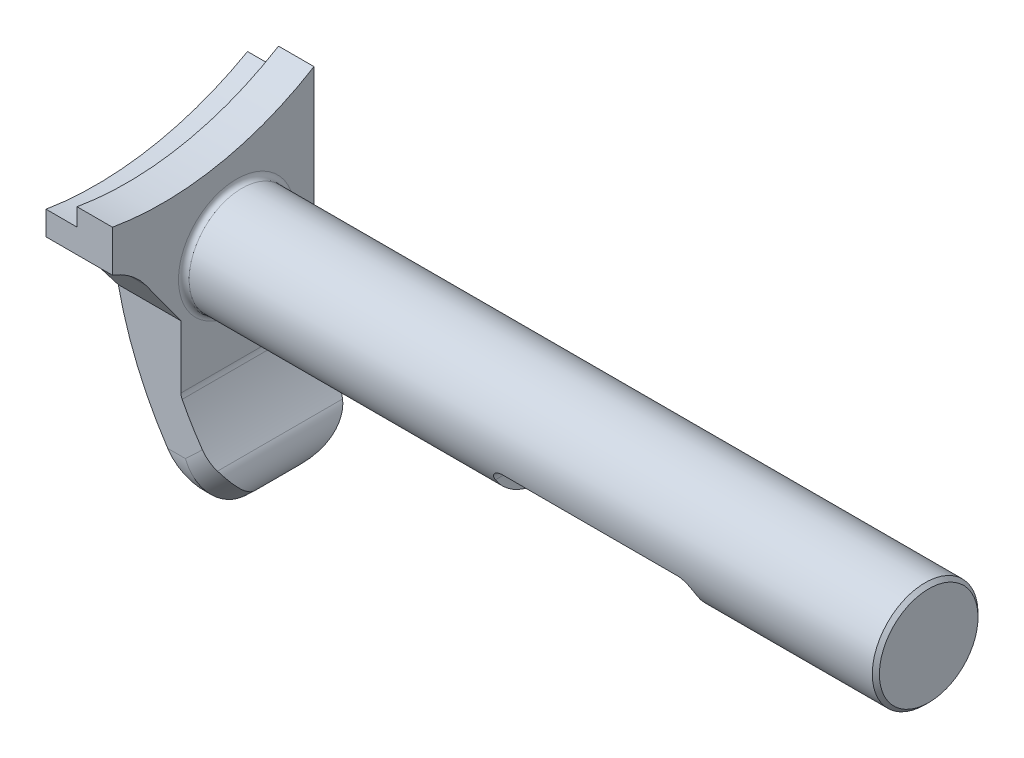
ISO-10303-21;
HEADER;
FILE_DESCRIPTION(('STEP AP214'),'2;1');
FILE_NAME('part.step','',(''),(''),'','','');
FILE_SCHEMA(('AUTOMOTIVE_DESIGN { 1 0 10303 214 1 1 1 1 }'));
ENDSEC;
DATA;
#1=APPLICATION_CONTEXT('core data for automotive mechanical design processes');
#2=APPLICATION_PROTOCOL_DEFINITION('international standard','automotive_design',2000,#1);
#3=PRODUCT_CONTEXT('',#1,'mechanical');
#4=PRODUCT('Part','Part','',(#3));
#5=PRODUCT_RELATED_PRODUCT_CATEGORY('part','',(#4));
#6=PRODUCT_DEFINITION_FORMATION('','',#4);
#7=PRODUCT_DEFINITION_CONTEXT('part definition',#1,'design');
#8=PRODUCT_DEFINITION('design','',#6,#7);
#9=PRODUCT_DEFINITION_SHAPE('','',#8);
#10=(LENGTH_UNIT() NAMED_UNIT(*) SI_UNIT(.MILLI.,.METRE.));
#11=(NAMED_UNIT(*) PLANE_ANGLE_UNIT() SI_UNIT($,.RADIAN.));
#12=(NAMED_UNIT(*) SI_UNIT($,.STERADIAN.) SOLID_ANGLE_UNIT());
#13=UNCERTAINTY_MEASURE_WITH_UNIT(LENGTH_MEASURE(1.E-05),#10,'distance_accuracy_value','');
#14=(GEOMETRIC_REPRESENTATION_CONTEXT(3) GLOBAL_UNCERTAINTY_ASSIGNED_CONTEXT((#13)) GLOBAL_UNIT_ASSIGNED_CONTEXT((#10,
#11,#12)) REPRESENTATION_CONTEXT('',''));
#15=CARTESIAN_POINT('',(0.,0.,0.));
#16=DIRECTION('',(0.,0.,1.));
#17=DIRECTION('',(1.,0.,0.));
#18=AXIS2_PLACEMENT_3D('',#15,#16,#17);
#19=CARTESIAN_POINT('',(15.9689446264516,-0.720330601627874,0.812800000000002));
#20=DIRECTION('',(-0.726548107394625,-0.687115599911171,0.));
#21=DIRECTION('',(0.687115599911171,-0.726548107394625,0.));
#22=AXIS2_PLACEMENT_3D('',#19,#20,#21);
#23=CYLINDRICAL_SURFACE('',#22,3.175);
#24=CARTESIAN_POINT('',(5.08083712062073,-11.0174994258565,0.812800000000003));
#25=DIRECTION('',(-0.929125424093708,-0.369764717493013,0.));
#26=DIRECTION('',(-0.369764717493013,0.929125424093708,0.));
#27=AXIS2_PLACEMENT_3D('',#24,#25,#26);
#28=ELLIPSE('',#27,3.41719203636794,3.175);
#29=CARTESIAN_POINT('',(6.34439416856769,-14.1924994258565,0.812800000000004));
#30=VERTEX_POINT('',#29);
#31=CARTESIAN_POINT('',(5.08083712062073,-11.0174994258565,3.9878));
#32=VERTEX_POINT('',#31);
#33=EDGE_CURVE('E454',#30,#32,#28,.T.);
#34=ORIENTED_EDGE('',*,*,#33,.F.);
#35=DIRECTION('',(0.726548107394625,0.687115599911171,0.));
#36=VECTOR('',#35,1.);
#37=CARTESIAN_POINT('',(18.1505366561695,-3.02712084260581,0.812800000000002));
#38=LINE('',#37,#36);
#39=CARTESIAN_POINT('',(6.89408845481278,-13.6726391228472,0.812800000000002));
#40=VERTEX_POINT('',#39);
#41=EDGE_CURVE('E12',#40,#30,#38,.F.);
#42=ORIENTED_EDGE('',*,*,#41,.F.);
#43=CARTESIAN_POINT('',(7.08959376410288,-10.9331868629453,3.7008595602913));
#44=CARTESIAN_POINT('',(7.12742421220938,-10.9808520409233,3.67318629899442));
#45=CARTESIAN_POINT('',(7.16255801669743,-11.0295296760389,3.64368845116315));
#46=CARTESIAN_POINT('',(7.22751612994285,-11.1282000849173,3.58146991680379));
#47=CARTESIAN_POINT('',(7.25734958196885,-11.1781904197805,3.54875493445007));
#48=CARTESIAN_POINT('',(7.3116393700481,-11.2784257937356,3.48078280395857));
#49=CARTESIAN_POINT('',(7.33614813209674,-11.3286628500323,3.44555545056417));
#50=CARTESIAN_POINT('',(7.38041727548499,-11.4294369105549,3.37260769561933));
#51=CARTESIAN_POINT('',(7.40017501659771,-11.479974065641,3.33488592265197));
#52=CARTESIAN_POINT('',(7.46243896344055,-11.6595013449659,3.19687695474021));
#53=CARTESIAN_POINT('',(7.49253782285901,-11.7882725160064,3.09052191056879));
#54=CARTESIAN_POINT('',(7.52798101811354,-12.0410690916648,2.86773133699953));
#55=CARTESIAN_POINT('',(7.53319262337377,-12.1650655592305,2.75124512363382));
#56=CARTESIAN_POINT('',(7.52425621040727,-12.3688188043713,2.54818478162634));
#57=CARTESIAN_POINT('',(7.51551447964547,-12.4505601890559,2.46328913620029));
#58=CARTESIAN_POINT('',(7.48896980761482,-12.6099023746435,2.2910439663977));
#59=CARTESIAN_POINT('',(7.47116308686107,-12.6875014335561,2.20369343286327));
#60=CARTESIAN_POINT('',(7.40558444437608,-12.9133961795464,1.93904298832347));
#61=CARTESIAN_POINT('',(7.3456383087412,-13.0550263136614,1.75890672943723));
#62=CARTESIAN_POINT('',(7.22192544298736,-13.2767310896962,1.45218872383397));
#63=CARTESIAN_POINT('',(7.16521864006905,-13.3622029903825,1.32647961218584));
#64=CARTESIAN_POINT('',(7.04043989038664,-13.5228751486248,1.07435329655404));
#65=CARTESIAN_POINT('',(6.97238658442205,-13.5980918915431,0.947937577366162));
#66=CARTESIAN_POINT('',(6.89749554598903,-13.6694113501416,0.818666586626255));
#67=CARTESIAN_POINT('',(6.89579338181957,-13.6710267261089,0.815733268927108));
#68=CARTESIAN_POINT('',(6.89408845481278,-13.6726391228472,0.812800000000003));
#69=B_SPLINE_CURVE_WITH_KNOTS('',3,(#43,#44,#45,#46,#47,#48,#49,#50,#51,#52,#53,#54,#55,#56,#57,
#58,#59,#60,#61,#62,#63,#64,#65,#66,#67,#68),.UNSPECIFIED.,.F.,.F.,(4,2,2,2,2,2,2,2,2,2,2,2,4),
(0.,0.200392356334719,0.400435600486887,0.598409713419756,0.796493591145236,1.30263115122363,
1.81146509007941,2.16553187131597,2.5197463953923,3.2271799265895,3.7133370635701,
4.19870323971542,4.20997267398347),.UNSPECIFIED.);
#70=CARTESIAN_POINT('',(7.08959376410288,-10.9331868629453,3.7008595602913));
#71=VERTEX_POINT('',#70);
#72=EDGE_CURVE('E47',#71,#40,#69,.T.);
#73=ORIENTED_EDGE('',*,*,#72,.F.);
#74=CARTESIAN_POINT('',(6.29662382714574,-9.867698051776,3.9878));
#75=CARTESIAN_POINT('',(6.34833857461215,-9.94188949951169,3.98781058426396));
#76=CARTESIAN_POINT('',(6.40053418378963,-10.0157495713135,3.98402127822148));
#77=CARTESIAN_POINT('',(6.50547693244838,-10.1622916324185,3.96887352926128));
#78=CARTESIAN_POINT('',(6.55822407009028,-10.2349736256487,3.95751511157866));
#79=CARTESIAN_POINT('',(6.66239395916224,-10.3766507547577,3.92767968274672));
#80=CARTESIAN_POINT('',(6.71381283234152,-10.4456922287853,3.90940901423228));
#81=CARTESIAN_POINT('',(6.81637954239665,-10.5817252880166,3.86583957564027));
#82=CARTESIAN_POINT('',(6.86752738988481,-10.6487169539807,3.8405410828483));
#83=CARTESIAN_POINT('',(6.96915382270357,-10.7802494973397,3.78305274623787));
#84=CARTESIAN_POINT('',(7.01963215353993,-10.8447894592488,3.75086035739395));
#85=CARTESIAN_POINT('',(7.11947266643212,-10.970995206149,3.67979311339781));
#86=CARTESIAN_POINT('',(7.16883479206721,-11.0326608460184,3.64091792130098));
#87=CARTESIAN_POINT('',(7.26739392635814,-11.1544568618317,3.5555373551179));
#88=CARTESIAN_POINT('',(7.31654603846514,-11.214493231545,3.50884592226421));
#89=CARTESIAN_POINT('',(7.41274498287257,-11.3307730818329,3.40900434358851));
#90=CARTESIAN_POINT('',(7.45979164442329,-11.3870162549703,3.3558536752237));
#91=CARTESIAN_POINT('',(7.50554950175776,-11.441179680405,3.29964854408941));
#92=B_SPLINE_CURVE_WITH_KNOTS('',3,(#74,#75,#76,#77,#78,#79,#80,#81,#82,#83,#84,#85,#86,#87,#88,
#89,#90,#91),.UNSPECIFIED.,.F.,.F.,(4,2,2,2,2,2,2,2,4),(0.,0.271233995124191,0.542467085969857,
0.806171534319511,1.06986557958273,1.33365714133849,1.59746200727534,1.86879383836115,
2.14014763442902),.UNSPECIFIED.);
#93=CARTESIAN_POINT('',(6.29662382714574,-9.867698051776,3.9878));
#94=VERTEX_POINT('',#93);
#95=EDGE_CURVE('E305',#94,#71,#92,.T.);
#96=ORIENTED_EDGE('',*,*,#95,.F.);
#97=DIRECTION('',(0.726548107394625,0.687115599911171,0.));
#98=VECTOR('',#97,1.);
#99=CARTESIAN_POINT('',(15.9689446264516,-0.720330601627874,3.9878));
#100=LINE('',#99,#98);
#101=EDGE_CURVE('E312',#32,#94,#100,.T.);
#102=ORIENTED_EDGE('',*,*,#101,.F.);
#103=EDGE_LOOP('',(#34,#42,#73,#96,#102));
#104=FACE_BOUND('',#103,.T.);
#105=ADVANCED_FACE('F39',(#104),#23,.T.);
#106=CARTESIAN_POINT('',(21.4600745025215,4.47277493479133,-2.3622));
#107=DIRECTION('',(0.726548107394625,0.687115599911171,0.));
#108=DIRECTION('',(-0.687115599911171,0.726548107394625,0.));
#109=AXIS2_PLACEMENT_3D('',#106,#107,#108);
#110=CYLINDRICAL_SURFACE('',#109,3.175);
#111=DIRECTION('',(-0.726548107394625,-0.687115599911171,0.));
#112=VECTOR('',#111,1.);
#113=CARTESIAN_POINT('',(21.4600745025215,4.47277493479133,-5.5372));
#114=LINE('',#113,#112);
#115=CARTESIAN_POINT('',(6.29662382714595,-9.86769805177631,-5.5372));
#116=VERTEX_POINT('',#115);
#117=CARTESIAN_POINT('',(5.08083712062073,-11.0174994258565,-5.5372));
#118=VERTEX_POINT('',#117);
#119=EDGE_CURVE('E417',#116,#118,#114,.T.);
#120=ORIENTED_EDGE('',*,*,#119,.F.);
#121=CARTESIAN_POINT('',(7.08959376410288,-10.9331868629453,-5.2502595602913));
#122=CARTESIAN_POINT('',(7.03824775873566,-10.8684904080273,-5.28785242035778));
#123=CARTESIAN_POINT('',(6.98627826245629,-10.8022243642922,-5.32188655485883));
#124=CARTESIAN_POINT('',(6.88156512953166,-10.6670249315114,-5.38265091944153));
#125=CARTESIAN_POINT('',(6.82882159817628,-10.5980919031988,-5.40938213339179));
#126=CARTESIAN_POINT('',(6.72446781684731,-10.4599306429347,-5.45473483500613));
#127=CARTESIAN_POINT('',(6.67286608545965,-10.3907621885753,-5.47355835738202));
#128=CARTESIAN_POINT('',(6.56977247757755,-10.2507874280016,-5.50403470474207));
#129=CARTESIAN_POINT('',(6.51828059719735,-10.1799811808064,-5.51568778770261));
#130=CARTESIAN_POINT('',(6.41582470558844,-10.0372456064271,-5.53177435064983));
#131=CARTESIAN_POINT('',(6.36486038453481,-9.96531700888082,-5.53621233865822));
#132=CARTESIAN_POINT('',(6.26378480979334,-9.82077642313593,-5.53789315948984));
#133=CARTESIAN_POINT('',(6.21367359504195,-9.74816440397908,-5.53513566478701));
#134=CARTESIAN_POINT('',(6.11324265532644,-9.60070313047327,-5.52230196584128));
#135=CARTESIAN_POINT('',(6.06295687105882,-9.5258485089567,-5.51202164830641));
#136=CARTESIAN_POINT('',(5.96396208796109,-9.37648878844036,-5.48403581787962));
#137=CARTESIAN_POINT('',(5.91525303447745,-9.30198367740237,-5.46633056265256));
#138=CARTESIAN_POINT('',(5.86749137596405,-9.22792470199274,-5.44497416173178));
#139=B_SPLINE_CURVE_WITH_KNOTS('',3,(#121,#122,#123,#124,#125,#126,#127,#128,#129,#130,#131,
#132,#133,#134,#135,#136,#137,#138),.UNSPECIFIED.,.F.,.F.,(4,2,2,2,2,2,2,2,4),(0.,
0.272157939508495,0.544279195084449,0.808948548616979,1.07360837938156,1.33810278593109,
1.60260923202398,1.87457175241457,2.1465248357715),.UNSPECIFIED.);
#140=CARTESIAN_POINT('',(7.08959376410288,-10.9331868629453,-5.2502595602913));
#141=VERTEX_POINT('',#140);
#142=EDGE_CURVE('E297',#141,#116,#139,.T.);
#143=ORIENTED_EDGE('',*,*,#142,.F.);
#144=CARTESIAN_POINT('',(6.89408845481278,-13.6726391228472,-2.3622));
#145=CARTESIAN_POINT('',(6.89579334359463,-13.6710267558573,-2.36513321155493));
#146=CARTESIAN_POINT('',(6.89749550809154,-13.6694113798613,-2.36806652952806));
#147=CARTESIAN_POINT('',(7.02872234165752,-13.5444432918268,-2.59457927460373));
#148=CARTESIAN_POINT('',(7.14237622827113,-13.4036477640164,-2.81873325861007));
#149=CARTESIAN_POINT('',(7.28375568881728,-13.1699280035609,-3.15120800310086));
#150=CARTESIAN_POINT('',(7.32607678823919,-13.0881160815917,-3.26158265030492));
#151=CARTESIAN_POINT('',(7.39989761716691,-12.917368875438,-3.48040227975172));
#152=CARTESIAN_POINT('',(7.4314040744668,-12.8284380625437,-3.58884842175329));
#153=CARTESIAN_POINT('',(7.49106360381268,-12.612007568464,-3.84001883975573));
#154=CARTESIAN_POINT('',(7.51429347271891,-12.4818013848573,-3.98163501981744));
#155=CARTESIAN_POINT('',(7.53432625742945,-12.2112097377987,-4.25677066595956));
#156=CARTESIAN_POINT('',(7.5311738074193,-12.070841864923,-4.39030342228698));
#157=CARTESIAN_POINT('',(7.49771181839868,-11.8205113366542,-4.61190213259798));
#158=CARTESIAN_POINT('',(7.47464636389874,-11.7120881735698,-4.70278735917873));
#159=CARTESIAN_POINT('',(7.40807651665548,-11.494137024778,-4.87492440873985));
#160=CARTESIAN_POINT('',(7.36464948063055,-11.3846147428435,-4.95621124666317));
#161=CARTESIAN_POINT('',(7.28817739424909,-11.2339458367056,-5.06062295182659));
#162=CARTESIAN_POINT('',(7.26475828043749,-11.1915375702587,-5.08917168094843));
#163=CARTESIAN_POINT('',(7.21424780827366,-11.1075002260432,-5.14407294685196));
#164=CARTESIAN_POINT('',(7.18715792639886,-11.0658708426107,-5.17042635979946));
#165=CARTESIAN_POINT('',(7.12899182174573,-10.9834341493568,-5.22091996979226));
#166=CARTESIAN_POINT('',(7.09788496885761,-10.9426362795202,-5.24504042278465));
#167=CARTESIAN_POINT('',(7.03182955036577,-10.8626170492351,-5.29064550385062));
#168=CARTESIAN_POINT('',(6.99687635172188,-10.8233976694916,-5.31212688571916));
#169=CARTESIAN_POINT('',(6.96002303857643,-10.7852188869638,-5.3321696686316));
#170=B_SPLINE_CURVE_WITH_KNOTS('',3,(#144,#145,#146,#147,#148,#149,#150,#151,#152,#153,#154,
#155,#156,#157,#158,#159,#160,#161,#162,#163,#164,#165,#166,#167,#168,#169),.UNSPECIFIED.,.F.,
.F.,(4,2,2,2,2,2,2,2,2,2,2,2,4),(0.,0.0112694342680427,0.870203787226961,1.30106945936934,
1.73166660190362,2.31109802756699,2.8895493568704,3.31820331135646,3.74524177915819,
3.91380394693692,4.08229851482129,4.2521635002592,4.42223538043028),.UNSPECIFIED.);
#171=CARTESIAN_POINT('',(6.89408845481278,-13.6726391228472,-2.3622));
#172=VERTEX_POINT('',#171);
#173=EDGE_CURVE('E423',#172,#141,#170,.T.);
#174=ORIENTED_EDGE('',*,*,#173,.F.);
#175=DIRECTION('',(-0.726548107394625,-0.687115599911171,0.));
#176=VECTOR('',#175,1.);
#177=CARTESIAN_POINT('',(23.6416665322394,2.1659846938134,-2.3622));
#178=LINE('',#177,#176);
#179=CARTESIAN_POINT('',(6.34439416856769,-14.1924994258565,-2.36219999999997));
#180=VERTEX_POINT('',#179);
#181=EDGE_CURVE('E328',#180,#172,#178,.F.);
#182=ORIENTED_EDGE('',*,*,#181,.F.);
#183=CARTESIAN_POINT('',(5.08083712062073,-11.0174994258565,-2.3622));
#184=DIRECTION('',(-0.929125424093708,-0.369764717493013,0.));
#185=DIRECTION('',(-0.369764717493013,0.929125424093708,0.));
#186=AXIS2_PLACEMENT_3D('',#183,#184,#185);
#187=ELLIPSE('',#186,3.41719203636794,3.175);
#188=EDGE_CURVE('E420',#118,#180,#187,.T.);
#189=ORIENTED_EDGE('',*,*,#188,.F.);
#190=EDGE_LOOP('',(#120,#143,#174,#182,#189));
#191=FACE_BOUND('',#190,.T.);
#192=ADVANCED_FACE('F428',(#191),#110,.T.);
#193=CARTESIAN_POINT('',(0.,0.,8.89));
#194=DIRECTION('',(1.,0.,0.));
#195=DIRECTION('',(0.,0.,-1.));
#196=AXIS2_PLACEMENT_3D('',#193,#194,#195);
#197=PLANE('',#196);
#198=DIRECTION('',(0.,-1.,0.));
#199=VECTOR('',#198,1.);
#200=CARTESIAN_POINT('',(0.,0.,8.89));
#201=LINE('',#200,#199);
#202=CARTESIAN_POINT('',(0.,4.35717258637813,8.89));
#203=VERTEX_POINT('',#202);
#204=CARTESIAN_POINT('',(0.,2.64161071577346,8.89));
#205=VERTEX_POINT('',#204);
#206=EDGE_CURVE('E463',#203,#205,#201,.T.);
#207=ORIENTED_EDGE('',*,*,#206,.F.);
#208=CARTESIAN_POINT('',(0.,26.0858,5.3086));
#209=DIRECTION('',(-1.,0.,0.));
#210=DIRECTION('',(0.,0.,1.));
#211=AXIS2_PLACEMENT_3D('',#208,#209,#210);
#212=CIRCLE('',#211,22.0218);
#213=CARTESIAN_POINT('',(0.,6.91998935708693,-5.5372));
#214=VERTEX_POINT('',#213);
#215=EDGE_CURVE('E189',#214,#203,#212,.T.);
#216=ORIENTED_EDGE('',*,*,#215,.F.);
#217=DIRECTION('',(0.,-1.,0.));
#218=VECTOR('',#217,1.);
#219=CARTESIAN_POINT('',(0.,8.36404325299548,-5.5372));
#220=LINE('',#219,#218);
#221=CARTESIAN_POINT('',(0.,-1.10432267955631,-5.5372));
#222=VERTEX_POINT('',#221);
#223=EDGE_CURVE('E194',#214,#222,#220,.T.);
#224=ORIENTED_EDGE('',*,*,#223,.T.);
#225=DIRECTION('',(0.,0.,-1.));
#226=VECTOR('',#225,1.);
#227=CARTESIAN_POINT('',(0.,-1.10432267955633,8.89));
#228=LINE('',#227,#226);
#229=CARTESIAN_POINT('',(0.,-1.10432267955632,5.10013441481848));
#230=VERTEX_POINT('',#229);
#231=EDGE_CURVE('E331',#230,#222,#228,.T.);
#232=ORIENTED_EDGE('',*,*,#231,.F.);
#233=DIRECTION('',(0.,0.809016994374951,0.587785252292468));
#234=VECTOR('',#233,1.);
#235=CARTESIAN_POINT('',(0.,-2.63531965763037,3.9878));
#236=LINE('',#235,#234);
#237=CARTESIAN_POINT('',(0.,0.825397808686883,6.50215841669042));
#238=VERTEX_POINT('',#237);
#239=EDGE_CURVE('E199',#230,#238,#236,.T.);
#240=ORIENTED_EDGE('',*,*,#239,.T.);
#241=CARTESIAN_POINT('',(0.,-2.2352,10.7147099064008));
#242=DIRECTION('',(1.,0.,0.));
#243=DIRECTION('',(0.,0.,-1.));
#244=AXIS2_PLACEMENT_3D('',#241,#242,#243);
#245=CIRCLE('',#244,5.207);
#246=EDGE_CURVE('E202',#238,#205,#245,.T.);
#247=ORIENTED_EDGE('',*,*,#246,.T.);
#248=EDGE_LOOP('',(#207,#216,#224,#232,#240,#247));
#249=FACE_BOUND('',#248,.T.);
#250=ADVANCED_FACE('F432',(#249),#197,.F.);
#251=CARTESIAN_POINT('',(23.876,2.3876,8.89));
#252=DIRECTION('',(0.,0.,-1.));
#253=DIRECTION('',(-1.,0.,0.));
#254=AXIS2_PLACEMENT_3D('',#251,#252,#253);
#255=CYLINDRICAL_SURFACE('',#254,24.13);
#256=CARTESIAN_POINT('',(23.876,2.3876,7.63716474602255));
#257=DIRECTION('',(0.,-0.587785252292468,0.809016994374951));
#258=DIRECTION('',(0.,-0.809016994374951,-0.587785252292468));
#259=AXIS2_PLACEMENT_3D('',#256,#257,#258);
#260=ELLIPSE('',#259,29.8263202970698,24.13);
#261=CARTESIAN_POINT('',(0.274576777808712,-2.63531965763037,3.9878));
#262=VERTEX_POINT('',#261);
#263=EDGE_CURVE('E238',#230,#262,#260,.T.);
#264=ORIENTED_EDGE('',*,*,#263,.F.);
#265=ORIENTED_EDGE('',*,*,#231,.T.);
#266=CARTESIAN_POINT('',(23.876,2.3876,-5.5372));
#267=DIRECTION('',(0.,0.,-1.));
#268=DIRECTION('',(0.,1.,0.));
#269=AXIS2_PLACEMENT_3D('',#266,#267,#268);
#270=CIRCLE('',#269,24.13);
#271=CARTESIAN_POINT('',(3.8120968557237,-11.0174994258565,-5.5372));
#272=VERTEX_POINT('',#271);
#273=EDGE_CURVE('E227',#272,#222,#270,.T.);
#274=ORIENTED_EDGE('',*,*,#273,.F.);
#275=CARTESIAN_POINT('',(6.3443941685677,-14.1924994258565,-2.36219999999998));
#276=CARTESIAN_POINT('',(6.34441563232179,-14.1925176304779,-2.4355954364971));
#277=CARTESIAN_POINT('',(6.34198801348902,-14.1899550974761,-2.50897534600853));
#278=CARTESIAN_POINT('',(6.33239943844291,-14.1798097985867,-2.65501448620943));
#279=CARTESIAN_POINT('',(6.32524255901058,-14.1722313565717,-2.72767428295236));
#280=CARTESIAN_POINT('',(6.30644297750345,-14.1522833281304,-2.87107740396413));
#281=CARTESIAN_POINT('',(6.29484036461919,-14.1399565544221,-2.94183197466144));
#282=CARTESIAN_POINT('',(6.26743762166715,-14.110758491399,-3.08155693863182));
#283=CARTESIAN_POINT('',(6.25163680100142,-14.0938864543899,-3.15052703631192));
#284=CARTESIAN_POINT('',(6.19855082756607,-14.0369967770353,-3.35363141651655));
#285=CARTESIAN_POINT('',(6.15549958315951,-13.9906190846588,-3.48455685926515));
#286=CARTESIAN_POINT('',(6.05700529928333,-13.8834058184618,-3.7354944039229));
#287=CARTESIAN_POINT('',(6.00153204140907,-13.8225349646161,-3.85547887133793));
#288=CARTESIAN_POINT('',(5.85636867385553,-13.6612566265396,-4.13022300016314));
#289=CARTESIAN_POINT('',(5.76198512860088,-13.5548811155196,-4.27901246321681));
#290=CARTESIAN_POINT('',(5.5610065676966,-13.3235909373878,-4.55187846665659));
#291=CARTESIAN_POINT('',(5.45438845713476,-13.198641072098,-4.67590701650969));
#292=CARTESIAN_POINT('',(5.20630364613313,-12.9011368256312,-4.92721473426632));
#293=CARTESIAN_POINT('',(5.06277367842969,-12.724478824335,-5.04760186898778));
#294=CARTESIAN_POINT('',(4.7711228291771,-12.3540483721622,-5.24989737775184));
#295=CARTESIAN_POINT('',(4.62300258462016,-12.1602782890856,-5.3318110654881));
#296=CARTESIAN_POINT('',(4.36298904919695,-11.8086997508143,-5.44112725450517));
#297=CARTESIAN_POINT('',(4.25100296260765,-11.6535359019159,-5.47692410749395));
#298=CARTESIAN_POINT('',(4.08476909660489,-11.4172307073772,-5.51294179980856));
#299=CARTESIAN_POINT('',(4.02970120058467,-11.3379476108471,-5.52200118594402));
#300=CARTESIAN_POINT('',(3.92029614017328,-11.1783929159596,-5.53412924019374));
#301=CARTESIAN_POINT('',(3.86595918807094,-11.0981210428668,-5.5371962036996));
#302=CARTESIAN_POINT('',(3.8120968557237,-11.0174994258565,-5.5372));
#303=B_SPLINE_CURVE_WITH_KNOTS('',3,(#275,#276,#277,#278,#279,#280,#281,#282,#283,#284,#285,
#286,#287,#288,#289,#290,#291,#292,#293,#294,#295,#296,#297,#298,#299,#300,#301,#302),
.UNSPECIFIED.,.F.,.F.,(4,2,2,2,2,2,2,2,2,2,2,2,2,4),(0.,0.220076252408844,0.439963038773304,
0.657911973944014,0.875896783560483,1.31006387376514,1.74529884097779,2.35938065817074,
2.97464134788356,3.74322326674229,4.51169900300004,5.09421199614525,5.38490570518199,
5.67568209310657),.UNSPECIFIED.);
#304=EDGE_CURVE('E240',#180,#272,#303,.T.);
#305=ORIENTED_EDGE('',*,*,#304,.F.);
#306=DIRECTION('',(0.,0.,-1.));
#307=VECTOR('',#306,1.);
#308=CARTESIAN_POINT('',(6.34439416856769,-14.1924994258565,8.89));
#309=LINE('',#308,#307);
#310=EDGE_CURVE('E329',#30,#180,#309,.T.);
#311=ORIENTED_EDGE('',*,*,#310,.F.);
#312=CARTESIAN_POINT('',(3.8120968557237,-11.0174994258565,3.9878));
#313=CARTESIAN_POINT('',(3.88689999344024,-11.1294796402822,3.98779026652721));
#314=CARTESIAN_POINT('',(3.96264056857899,-11.2407948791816,3.98187630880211));
#315=CARTESIAN_POINT('',(4.11537987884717,-11.4613220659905,3.95858342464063));
#316=CARTESIAN_POINT('',(4.19237841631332,-11.5705343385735,3.94120628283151));
#317=CARTESIAN_POINT('',(4.34744935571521,-11.7866873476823,3.89520904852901));
#318=CARTESIAN_POINT('',(4.42552528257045,-11.8936130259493,3.8665300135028));
#319=CARTESIAN_POINT('',(4.5816637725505,-12.1038688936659,3.79820570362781));
#320=CARTESIAN_POINT('',(4.65972633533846,-12.2071990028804,3.75856018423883));
#321=CARTESIAN_POINT('',(4.88921816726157,-12.5060504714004,3.62556663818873));
#322=CARTESIAN_POINT('',(5.03977768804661,-12.6957360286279,3.51701500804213));
#323=CARTESIAN_POINT('',(5.33153939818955,-13.0530241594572,3.25935940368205));
#324=CARTESIAN_POINT('',(5.47276325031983,-13.2206788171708,3.11035372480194));
#325=CARTESIAN_POINT('',(5.69473346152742,-13.4780103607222,2.8254410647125));
#326=CARTESIAN_POINT('',(5.78042650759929,-13.575526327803,2.70044797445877));
#327=CARTESIAN_POINT('',(5.93905174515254,-13.7535565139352,2.43159964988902));
#328=CARTESIAN_POINT('',(6.01200208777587,-13.8340949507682,2.28777176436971));
#329=CARTESIAN_POINT('',(6.12762015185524,-13.9604219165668,2.01205436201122));
#330=CARTESIAN_POINT('',(6.17341329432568,-14.0099141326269,1.8831824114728));
#331=CARTESIAN_POINT('',(6.25012228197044,-14.092343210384,1.61615044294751));
#332=CARTESIAN_POINT('',(6.2810708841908,-14.1253165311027,1.47801164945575));
#333=CARTESIAN_POINT('',(6.31681080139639,-14.163296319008,1.25118147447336));
#334=CARTESIAN_POINT('',(6.32709865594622,-14.1741973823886,1.1642898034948));
#335=CARTESIAN_POINT('',(6.34091347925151,-14.1888191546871,0.989223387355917));
#336=CARTESIAN_POINT('',(6.34442859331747,-14.1925272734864,0.901046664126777));
#337=CARTESIAN_POINT('',(6.3443941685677,-14.1924994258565,0.812800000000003));
#338=B_SPLINE_CURVE_WITH_KNOTS('',3,(#312,#313,#314,#315,#316,#317,#318,#319,#320,#321,#322,
#323,#324,#325,#326,#327,#328,#329,#330,#331,#332,#333,#334,#335,#336,#337),.UNSPECIFIED.,.F.,
.F.,(4,2,2,2,2,2,2,2,2,2,2,2,4),(0.,0.40381738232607,0.807571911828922,1.21346060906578,
1.61935835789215,2.41148969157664,3.20171326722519,3.74053714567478,4.27858713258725,
4.71323635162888,5.14692197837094,5.410926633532,5.67539297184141),.UNSPECIFIED.);
#339=CARTESIAN_POINT('',(3.8120968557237,-11.0174994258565,3.9878));
#340=VERTEX_POINT('',#339);
#341=EDGE_CURVE('E249',#340,#30,#338,.T.);
#342=ORIENTED_EDGE('',*,*,#341,.F.);
#343=CARTESIAN_POINT('',(23.876,2.3876,3.9878));
#344=DIRECTION('',(0.,0.,1.));
#345=DIRECTION('',(0.,-1.,0.));
#346=AXIS2_PLACEMENT_3D('',#343,#344,#345);
#347=CIRCLE('',#346,24.13);
#348=EDGE_CURVE('E235',#262,#340,#347,.T.);
#349=ORIENTED_EDGE('',*,*,#348,.F.);
#350=EDGE_LOOP('',(#264,#265,#274,#305,#311,#342,#349));
#351=FACE_BOUND('',#350,.T.);
#352=ADVANCED_FACE('F256',(#351),#255,.T.);
#353=CARTESIAN_POINT('',(10.0805807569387,-10.6590897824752,8.89));
#354=DIRECTION('',(-0.687115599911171,0.726548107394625,0.));
#355=DIRECTION('',(-0.726548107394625,-0.687115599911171,0.));
#356=AXIS2_PLACEMENT_3D('',#353,#354,#355);
#357=PLANE('',#356);
#358=DIRECTION('',(0.,0.,-1.));
#359=VECTOR('',#358,1.);
#360=CARTESIAN_POINT('',(6.89408845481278,-13.6726391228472,8.89));
#361=LINE('',#360,#359);
#362=EDGE_CURVE('E321',#40,#172,#361,.T.);
#363=ORIENTED_EDGE('',*,*,#362,.F.);
#364=ORIENTED_EDGE('',*,*,#41,.T.);
#365=ORIENTED_EDGE('',*,*,#310,.T.);
#366=ORIENTED_EDGE('',*,*,#181,.T.);
#367=EDGE_LOOP('',(#363,#364,#365,#366));
#368=FACE_BOUND('',#367,.T.);
#369=ADVANCED_FACE('F326',(#368),#357,.F.);
#370=CARTESIAN_POINT('',(5.49786955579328,-12.1962933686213,8.89));
#371=DIRECTION('',(0.,0.,-1.));
#372=DIRECTION('',(-1.,0.,0.));
#373=AXIS2_PLACEMENT_3D('',#370,#371,#372);
#374=CYLINDRICAL_SURFACE('',#373,2.032);
#375=DIRECTION('',(0.,0.,-1.));
#376=VECTOR('',#375,1.);
#377=CARTESIAN_POINT('',(7.08959376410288,-10.9331868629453,8.89));
#378=LINE('',#377,#376);
#379=EDGE_CURVE('E323',#71,#141,#378,.T.);
#380=ORIENTED_EDGE('',*,*,#379,.F.);
#381=ORIENTED_EDGE('',*,*,#72,.T.);
#382=ORIENTED_EDGE('',*,*,#362,.T.);
#383=ORIENTED_EDGE('',*,*,#173,.T.);
#384=EDGE_LOOP('',(#380,#381,#382,#383));
#385=FACE_BOUND('',#384,.T.);
#386=ADVANCED_FACE('F292',(#385),#374,.T.);
#387=CARTESIAN_POINT('',(23.876,2.3876,8.89));
#388=DIRECTION('',(0.,0.,-1.));
#389=DIRECTION('',(-1.,0.,0.));
#390=AXIS2_PLACEMENT_3D('',#387,#388,#389);
#391=CYLINDRICAL_SURFACE('',#390,21.4295776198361);
#392=CARTESIAN_POINT('',(23.876,2.3876,3.9878));
#393=DIRECTION('',(0.,0.,1.));
#394=DIRECTION('',(0.,-1.,0.));
#395=AXIS2_PLACEMENT_3D('',#392,#393,#394);
#396=CIRCLE('',#395,21.4295776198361);
#397=CARTESIAN_POINT('',(4.8442536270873,-7.46224400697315,3.9878));
#398=VERTEX_POINT('',#397);
#399=EDGE_CURVE('E232',#398,#94,#396,.T.);
#400=ORIENTED_EDGE('',*,*,#399,.T.);
#401=ORIENTED_EDGE('',*,*,#95,.T.);
#402=ORIENTED_EDGE('',*,*,#379,.T.);
#403=ORIENTED_EDGE('',*,*,#142,.T.);
#404=CARTESIAN_POINT('',(23.876,2.3876,-5.5372));
#405=DIRECTION('',(0.,0.,-1.));
#406=DIRECTION('',(0.,1.,0.));
#407=AXIS2_PLACEMENT_3D('',#404,#405,#406);
#408=CIRCLE('',#407,21.4295776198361);
#409=CARTESIAN_POINT('',(4.8442536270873,-7.46224400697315,-5.5372));
#410=VERTEX_POINT('',#409);
#411=EDGE_CURVE('E225',#116,#410,#408,.T.);
#412=ORIENTED_EDGE('',*,*,#411,.T.);
#413=DIRECTION('',(0.,0.,-1.));
#414=VECTOR('',#413,1.);
#415=CARTESIAN_POINT('',(4.8442536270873,-7.46224400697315,8.89));
#416=LINE('',#415,#414);
#417=EDGE_CURVE('E333',#398,#410,#416,.T.);
#418=ORIENTED_EDGE('',*,*,#417,.F.);
#419=EDGE_LOOP('',(#400,#401,#402,#403,#412,#418));
#420=FACE_BOUND('',#419,.T.);
#421=ADVANCED_FACE('F287',(#420),#391,.F.);
#422=CARTESIAN_POINT('',(5.52099075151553,-7.112,8.89));
#423=DIRECTION('',(0.,0.,-1.));
#424=DIRECTION('',(-1.,0.,0.));
#425=AXIS2_PLACEMENT_3D('',#422,#423,#424);
#426=CYLINDRICAL_SURFACE('',#425,0.761999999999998);
#427=DIRECTION('',(0.,0.,-1.));
#428=VECTOR('',#427,1.);
#429=CARTESIAN_POINT('',(4.75899075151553,-7.112,8.89));
#430=LINE('',#429,#428);
#431=CARTESIAN_POINT('',(4.75899075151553,-7.112,3.9878));
#432=VERTEX_POINT('',#431);
#433=CARTESIAN_POINT('',(4.75899075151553,-7.112,-5.5372));
#434=VERTEX_POINT('',#433);
#435=EDGE_CURVE('E491',#432,#434,#430,.T.);
#436=ORIENTED_EDGE('',*,*,#435,.F.);
#437=CARTESIAN_POINT('',(5.52099075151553,-7.112,3.9878));
#438=DIRECTION('',(0.,0.,1.));
#439=DIRECTION('',(0.,-1.,0.));
#440=AXIS2_PLACEMENT_3D('',#437,#438,#439);
#441=CIRCLE('',#440,0.761999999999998);
#442=EDGE_CURVE('E229',#432,#398,#441,.T.);
#443=ORIENTED_EDGE('',*,*,#442,.T.);
#444=ORIENTED_EDGE('',*,*,#417,.T.);
#445=CARTESIAN_POINT('',(5.52099075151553,-7.112,-5.5372));
#446=DIRECTION('',(0.,0.,-1.));
#447=DIRECTION('',(0.,1.,0.));
#448=AXIS2_PLACEMENT_3D('',#445,#446,#447);
#449=CIRCLE('',#448,0.761999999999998);
#450=EDGE_CURVE('E222',#410,#434,#449,.T.);
#451=ORIENTED_EDGE('',*,*,#450,.T.);
#452=EDGE_LOOP('',(#436,#443,#444,#451));
#453=FACE_BOUND('',#452,.T.);
#454=ADVANCED_FACE('F283',(#453),#426,.F.);
#455=CARTESIAN_POINT('',(4.75899075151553,0.,8.89));
#456=DIRECTION('',(1.,0.,0.));
#457=DIRECTION('',(0.,0.,-1.));
#458=AXIS2_PLACEMENT_3D('',#455,#456,#457);
#459=PLANE('',#458);
#460=CARTESIAN_POINT('',(4.75899075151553,0.,0.));
#461=DIRECTION('',(1.,0.,0.));
#462=DIRECTION('',(0.,0.,-1.));
#463=AXIS2_PLACEMENT_3D('',#460,#461,#462);
#464=CIRCLE('',#463,4.1656);
#465=CARTESIAN_POINT('',(4.75899075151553,0.,-4.1656));
#466=VERTEX_POINT('',#465);
#467=EDGE_CURVE('E411',#466,#466,#464,.F.);
#468=ORIENTED_EDGE('',*,*,#467,.T.);
#469=EDGE_LOOP('',(#468));
#470=FACE_BOUND('',#469,.T.);
#471=DIRECTION('',(0.,-1.,0.));
#472=VECTOR('',#471,1.);
#473=CARTESIAN_POINT('',(4.75899075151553,0.,8.89));
#474=LINE('',#473,#472);
#475=CARTESIAN_POINT('',(4.75899075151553,5.61959336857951,8.89));
#476=VERTEX_POINT('',#475);
#477=CARTESIAN_POINT('',(4.75899075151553,2.64161071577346,8.89));
#478=VERTEX_POINT('',#477);
#479=EDGE_CURVE('E487',#476,#478,#474,.T.);
#480=ORIENTED_EDGE('',*,*,#479,.T.);
#481=CARTESIAN_POINT('',(4.75899075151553,-2.2352,10.7147099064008));
#482=DIRECTION('',(1.,0.,0.));
#483=DIRECTION('',(0.,0.,-1.));
#484=AXIS2_PLACEMENT_3D('',#481,#482,#483);
#485=CIRCLE('',#484,5.207);
#486=CARTESIAN_POINT('',(4.75899075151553,0.825397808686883,6.50215841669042));
#487=VERTEX_POINT('',#486);
#488=EDGE_CURVE('E208',#478,#487,#485,.F.);
#489=ORIENTED_EDGE('',*,*,#488,.T.);
#490=DIRECTION('',(0.,-0.809016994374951,-0.587785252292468));
#491=VECTOR('',#490,1.);
#492=CARTESIAN_POINT('',(4.75899075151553,1.42065407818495,6.93463741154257));
#493=LINE('',#492,#491);
#494=CARTESIAN_POINT('',(4.75899075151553,-2.63531965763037,3.9878));
#495=VERTEX_POINT('',#494);
#496=EDGE_CURVE('E408',#487,#495,#493,.T.);
#497=ORIENTED_EDGE('',*,*,#496,.T.);
#498=DIRECTION('',(0.,-1.,0.));
#499=VECTOR('',#498,1.);
#500=CARTESIAN_POINT('',(4.75899075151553,0.,3.9878));
#501=LINE('',#500,#499);
#502=EDGE_CURVE('E405',#495,#432,#501,.T.);
#503=ORIENTED_EDGE('',*,*,#502,.T.);
#504=ORIENTED_EDGE('',*,*,#435,.T.);
#505=DIRECTION('',(0.,1.,0.));
#506=VECTOR('',#505,1.);
#507=CARTESIAN_POINT('',(4.75899075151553,0.,-5.5372));
#508=LINE('',#507,#506);
#509=CARTESIAN_POINT('',(4.75899075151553,8.36404325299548,-5.5372));
#510=VERTEX_POINT('',#509);
#511=EDGE_CURVE('E402',#434,#510,#508,.T.);
#512=ORIENTED_EDGE('',*,*,#511,.T.);
#513=CARTESIAN_POINT('',(4.75899075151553,26.0858,5.3086));
#514=DIRECTION('',(1.,0.,0.));
#515=DIRECTION('',(0.,0.,-1.));
#516=AXIS2_PLACEMENT_3D('',#513,#514,#515);
#517=CIRCLE('',#516,20.7772);
#518=EDGE_CURVE('E219',#510,#476,#517,.F.);
#519=ORIENTED_EDGE('',*,*,#518,.T.);
#520=EDGE_LOOP('',(#480,#489,#497,#503,#504,#512,#519));
#521=FACE_BOUND('',#520,.T.);
#522=ADVANCED_FACE('F279',(#470,#521),#459,.T.);
#523=CARTESIAN_POINT('',(0.,0.,8.89));
#524=DIRECTION('',(0.,0.,1.));
#525=DIRECTION('',(1.,0.,0.));
#526=AXIS2_PLACEMENT_3D('',#523,#524,#525);
#527=PLANE('',#526);
#528=DIRECTION('',(0.,1.,0.));
#529=VECTOR('',#528,1.);
#530=CARTESIAN_POINT('',(2.21899075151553,4.35717258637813,8.89));
#531=LINE('',#530,#529);
#532=CARTESIAN_POINT('',(2.21899075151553,4.35717258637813,8.89));
#533=VERTEX_POINT('',#532);
#534=CARTESIAN_POINT('',(2.21899075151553,5.61959336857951,8.89));
#535=VERTEX_POINT('',#534);
#536=EDGE_CURVE('E54',#533,#535,#531,.T.);
#537=ORIENTED_EDGE('',*,*,#536,.F.);
#538=DIRECTION('',(-1.,0.,0.));
#539=VECTOR('',#538,1.);
#540=CARTESIAN_POINT('',(19.81337455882,4.35717258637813,8.89));
#541=LINE('',#540,#539);
#542=EDGE_CURVE('E180',#533,#203,#541,.T.);
#543=ORIENTED_EDGE('',*,*,#542,.T.);
#544=ORIENTED_EDGE('',*,*,#206,.T.);
#545=DIRECTION('',(-1.,0.,0.));
#546=VECTOR('',#545,1.);
#547=CARTESIAN_POINT('',(17.78,2.64161071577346,8.89));
#548=LINE('',#547,#546);
#549=EDGE_CURVE('E394',#205,#478,#548,.F.);
#550=ORIENTED_EDGE('',*,*,#549,.T.);
#551=ORIENTED_EDGE('',*,*,#479,.F.);
#552=DIRECTION('',(-1.,0.,0.));
#553=VECTOR('',#552,1.);
#554=CARTESIAN_POINT('',(17.78,5.61959336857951,8.89));
#555=LINE('',#554,#553);
#556=EDGE_CURVE('E399',#476,#535,#555,.T.);
#557=ORIENTED_EDGE('',*,*,#556,.T.);
#558=EDGE_LOOP('',(#537,#543,#544,#550,#551,#557));
#559=FACE_BOUND('',#558,.T.);
#560=ADVANCED_FACE('F275',(#559),#527,.T.);
#561=CARTESIAN_POINT('',(54.3052,0.,0.));
#562=DIRECTION('',(-1.,0.,0.));
#563=DIRECTION('',(0.,-1.,0.));
#564=AXIS2_PLACEMENT_3D('',#561,#562,#563);
#565=PLANE('',#564);
#566=CARTESIAN_POINT('',(54.3052,0.,0.));
#567=DIRECTION('',(-1.,0.,0.));
#568=DIRECTION('',(0.,-1.,0.));
#569=AXIS2_PLACEMENT_3D('',#566,#567,#568);
#570=CIRCLE('',#569,3.5306);
#571=CARTESIAN_POINT('',(54.3052,-3.5306,0.));
#572=VERTEX_POINT('',#571);
#573=EDGE_CURVE('E354',#572,#572,#570,.T.);
#574=ORIENTED_EDGE('',*,*,#573,.F.);
#575=EDGE_LOOP('',(#574));
#576=FACE_BOUND('',#575,.T.);
#577=ADVANCED_FACE('F278',(#576),#565,.F.);
#578=CARTESIAN_POINT('',(54.3052,0.,0.));
#579=DIRECTION('',(-1.,0.,0.));
#580=DIRECTION('',(0.,-1.,0.));
#581=AXIS2_PLACEMENT_3D('',#578,#579,#580);
#582=CONICAL_SURFACE('',#581,3.5306,0.785398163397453);
#583=CARTESIAN_POINT('',(54.0512,0.,0.));
#584=DIRECTION('',(-1.,0.,0.));
#585=DIRECTION('',(0.,-1.,0.));
#586=AXIS2_PLACEMENT_3D('',#583,#584,#585);
#587=CIRCLE('',#586,3.7846);
#588=CARTESIAN_POINT('',(54.0512,-3.7846,0.));
#589=VERTEX_POINT('',#588);
#590=EDGE_CURVE('E343',#589,#589,#587,.T.);
#591=ORIENTED_EDGE('',*,*,#590,.F.);
#592=EDGE_LOOP('',(#591));
#593=FACE_BOUND('',#592,.T.);
#594=ORIENTED_EDGE('',*,*,#573,.T.);
#595=EDGE_LOOP('',(#594));
#596=FACE_BOUND('',#595,.T.);
#597=ADVANCED_FACE('F439',(#593,#596),#582,.T.);
#598=CARTESIAN_POINT('',(4.75899075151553,0.,0.));
#599=DIRECTION('',(-1.,0.,0.));
#600=DIRECTION('',(0.,-1.,0.));
#601=AXIS2_PLACEMENT_3D('',#598,#599,#600);
#602=CYLINDRICAL_SURFACE('',#601,3.7846);
#603=CARTESIAN_POINT('',(5.13999075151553,0.,0.));
#604=DIRECTION('',(1.,0.,0.));
#605=DIRECTION('',(0.,0.,-1.));
#606=AXIS2_PLACEMENT_3D('',#603,#604,#605);
#607=CIRCLE('',#606,3.7846);
#608=CARTESIAN_POINT('',(5.13999075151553,0.,-3.7846));
#609=VERTEX_POINT('',#608);
#610=EDGE_CURVE('E414',#609,#609,#607,.T.);
#611=ORIENTED_EDGE('',*,*,#610,.T.);
#612=EDGE_LOOP('',(#611));
#613=FACE_BOUND('',#612,.T.);
#614=CARTESIAN_POINT('',(39.9379907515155,-1.016,3.64567430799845));
#615=CARTESIAN_POINT('',(39.9655656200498,-1.01599972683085,3.64567257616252));
#616=CARTESIAN_POINT('',(39.9931272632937,-1.01712337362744,3.64536144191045));
#617=CARTESIAN_POINT('',(40.048052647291,-1.02160294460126,3.64410929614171));
#618=CARTESIAN_POINT('',(40.0754163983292,-1.02495875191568,3.64316831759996));
#619=CARTESIAN_POINT('',(40.1568523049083,-1.03833389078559,3.63938886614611));
#620=CARTESIAN_POINT('',(40.2103776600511,-1.05166107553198,3.63559395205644));
#621=CARTESIAN_POINT('',(40.3143389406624,-1.08667883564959,3.62528003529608));
#622=CARTESIAN_POINT('',(40.3647733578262,-1.10837345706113,3.61875971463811));
#623=CARTESIAN_POINT('',(40.4611409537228,-1.15933824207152,3.60275482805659));
#624=CARTESIAN_POINT('',(40.5070746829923,-1.18860747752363,3.59327062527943));
#625=CARTESIAN_POINT('',(40.5933407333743,-1.25373114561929,3.57106958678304));
#626=CARTESIAN_POINT('',(40.6336559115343,-1.28960498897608,3.55834317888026));
#627=CARTESIAN_POINT('',(40.7075591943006,-1.36651913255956,3.52951921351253));
#628=CARTESIAN_POINT('',(40.7411487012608,-1.40755835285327,3.51342236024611));
#629=CARTESIAN_POINT('',(40.8017459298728,-1.49436321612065,3.47740311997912));
#630=CARTESIAN_POINT('',(40.8285730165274,-1.54021976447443,3.45739695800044));
#631=CARTESIAN_POINT('',(40.8743616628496,-1.63424884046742,3.4139593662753));
#632=CARTESIAN_POINT('',(40.8933120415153,-1.68242455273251,3.39052313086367));
#633=CARTESIAN_POINT('',(40.9239664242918,-1.78124784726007,3.33968967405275));
#634=CARTESIAN_POINT('',(40.9353950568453,-1.83192308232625,3.31218292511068));
#635=CARTESIAN_POINT('',(40.9504086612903,-1.93267983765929,3.25444124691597));
#636=CARTESIAN_POINT('',(40.9540181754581,-1.98276272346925,3.22421516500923));
#637=CARTESIAN_POINT('',(40.9539907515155,-2.03200000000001,3.19283152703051));
#638=B_SPLINE_CURVE_WITH_KNOTS('',3,(#614,#615,#616,#617,#618,#619,#620,#621,#622,#623,#624,
#625,#626,#627,#628,#629,#630,#631,#632,#633,#634,#635,#636,#637),.UNSPECIFIED.,.F.,.F.,(4,2,2,
2,2,2,2,2,2,2,2,4),(0.,0.08267369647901,0.165343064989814,0.330360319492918,0.495457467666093,
0.660534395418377,0.826104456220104,0.991639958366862,1.16121536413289,1.33103066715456,
1.50676046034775,1.68193787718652),.UNSPECIFIED.);
#639=CARTESIAN_POINT('',(39.9379907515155,-1.016,3.64567430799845));
#640=VERTEX_POINT('',#639);
#641=CARTESIAN_POINT('',(40.9539907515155,-2.03200000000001,3.1928315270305));
#642=VERTEX_POINT('',#641);
#643=EDGE_CURVE('E386',#640,#642,#638,.T.);
#644=ORIENTED_EDGE('',*,*,#643,.T.);
#645=CARTESIAN_POINT('',(40.9539907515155,0.,0.));
#646=DIRECTION('',(1.,0.,0.));
#647=DIRECTION('',(0.,0.,-1.));
#648=AXIS2_PLACEMENT_3D('',#645,#646,#647);
#649=CIRCLE('',#648,3.7846);
#650=CARTESIAN_POINT('',(40.9539907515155,-2.03200000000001,-3.1928315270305));
#651=VERTEX_POINT('',#650);
#652=EDGE_CURVE('E357',#642,#651,#649,.T.);
#653=ORIENTED_EDGE('',*,*,#652,.T.);
#654=CARTESIAN_POINT('',(40.9539907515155,-2.03200000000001,-3.1928315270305));
#655=CARTESIAN_POINT('',(40.9539886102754,-2.00375524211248,-3.21080916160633));
#656=CARTESIAN_POINT('',(40.9528117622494,-1.97527675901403,-3.22840422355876));
#657=CARTESIAN_POINT('',(40.9479850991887,-1.9179989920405,-3.26275842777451));
#658=CARTESIAN_POINT('',(40.9443334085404,-1.88919948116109,-3.27951692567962));
#659=CARTESIAN_POINT('',(40.9294439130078,-1.80237683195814,-3.32851972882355));
#660=CARTESIAN_POINT('',(40.9142696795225,-1.74415545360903,-3.35934790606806));
#661=CARTESIAN_POINT('',(40.872726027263,-1.62915734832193,-3.41660586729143));
#662=CARTESIAN_POINT('',(40.8463027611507,-1.57238898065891,-3.44301363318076));
#663=CARTESIAN_POINT('',(40.7822970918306,-1.46333430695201,-3.49075682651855));
#664=CARTESIAN_POINT('',(40.7447458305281,-1.41103601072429,-3.51210611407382));
#665=CARTESIAN_POINT('',(40.6640910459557,-1.31901136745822,-3.54761490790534));
#666=CARTESIAN_POINT('',(40.62207851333,-1.27853310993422,-3.56231153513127));
#667=CARTESIAN_POINT('',(40.5309749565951,-1.20492546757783,-3.587878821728));
#668=CARTESIAN_POINT('',(40.4818808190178,-1.1717993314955,-3.59874779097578));
#669=CARTESIAN_POINT('',(40.3815854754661,-1.11627498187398,-3.61634111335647));
#670=CARTESIAN_POINT('',(40.3307315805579,-1.09331720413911,-3.62328988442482));
#671=CARTESIAN_POINT('',(40.2257034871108,-1.05600084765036,-3.63434199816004));
#672=CARTESIAN_POINT('',(40.1715331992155,-1.04163234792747,-3.63844862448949));
#673=CARTESIAN_POINT('',(40.087081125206,-1.0265513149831,-3.64272106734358));
#674=CARTESIAN_POINT('',(40.0573877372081,-1.02259577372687,-3.64383132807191));
#675=CARTESIAN_POINT('',(39.9977978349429,-1.01732174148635,-3.64530615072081));
#676=CARTESIAN_POINT('',(39.9679017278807,-1.01599898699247,-3.64567191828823));
#677=CARTESIAN_POINT('',(39.9379907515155,-1.016,-3.64567430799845));
#678=B_SPLINE_CURVE_WITH_KNOTS('',3,(#654,#655,#656,#657,#658,#659,#660,#661,#662,#663,#664,
#665,#666,#667,#668,#669,#670,#671,#672,#673,#674,#675,#676,#677),.UNSPECIFIED.,.F.,.F.,(4,2,2,
2,2,2,2,2,2,2,2,4),(0.,0.100397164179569,0.200870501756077,0.402610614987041,0.605327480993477,
0.807482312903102,0.987023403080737,1.16664367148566,1.3345267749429,1.5022155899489,
1.59203317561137,1.68170519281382),.UNSPECIFIED.);
#679=CARTESIAN_POINT('',(39.9379907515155,-1.016,-3.64567430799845));
#680=VERTEX_POINT('',#679);
#681=EDGE_CURVE('E360',#651,#680,#678,.T.);
#682=ORIENTED_EDGE('',*,*,#681,.T.);
#683=DIRECTION('',(-1.,0.,0.));
#684=VECTOR('',#683,1.);
#685=CARTESIAN_POINT('',(4.75899075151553,-1.016,-3.64567430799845));
#686=LINE('',#685,#684);
#687=CARTESIAN_POINT('',(27.4919907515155,-1.016,-3.64567430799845));
#688=VERTEX_POINT('',#687);
#689=EDGE_CURVE('E369',#680,#688,#686,.T.);
#690=ORIENTED_EDGE('',*,*,#689,.T.);
#691=CARTESIAN_POINT('',(27.4919907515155,-1.016,-3.64567430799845));
#692=CARTESIAN_POINT('',(27.4644158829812,-1.01599972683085,-3.64567257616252));
#693=CARTESIAN_POINT('',(27.4368542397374,-1.01712337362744,-3.64536144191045));
#694=CARTESIAN_POINT('',(27.38192885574,-1.02160294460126,-3.64410929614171));
#695=CARTESIAN_POINT('',(27.3545651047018,-1.02495875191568,-3.64316831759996));
#696=CARTESIAN_POINT('',(27.2731291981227,-1.03833389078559,-3.63938886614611));
#697=CARTESIAN_POINT('',(27.2196038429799,-1.05166107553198,-3.63559395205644));
#698=CARTESIAN_POINT('',(27.1156425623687,-1.08667883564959,-3.62528003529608));
#699=CARTESIAN_POINT('',(27.0652081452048,-1.10837345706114,-3.61875971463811));
#700=CARTESIAN_POINT('',(26.9688405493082,-1.15933824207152,-3.60275482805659));
#701=CARTESIAN_POINT('',(26.9229068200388,-1.18860747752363,-3.59327062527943));
#702=CARTESIAN_POINT('',(26.8366407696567,-1.25373114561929,-3.57106958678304));
#703=CARTESIAN_POINT('',(26.7963255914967,-1.28960498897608,-3.55834317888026));
#704=CARTESIAN_POINT('',(26.7224223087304,-1.36651913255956,-3.52951921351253));
#705=CARTESIAN_POINT('',(26.6888328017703,-1.40755835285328,-3.5134223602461));
#706=CARTESIAN_POINT('',(26.6282355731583,-1.49436321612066,-3.47740311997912));
#707=CARTESIAN_POINT('',(26.6014084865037,-1.54021976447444,-3.45739695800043));
#708=CARTESIAN_POINT('',(26.5556198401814,-1.63424884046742,-3.4139593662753));
#709=CARTESIAN_POINT('',(26.5366694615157,-1.68242455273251,-3.39052313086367));
#710=CARTESIAN_POINT('',(26.5060150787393,-1.78124784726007,-3.33968967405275));
#711=CARTESIAN_POINT('',(26.4945864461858,-1.83192308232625,-3.31218292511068));
#712=CARTESIAN_POINT('',(26.4795728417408,-1.93267983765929,-3.25444124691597));
#713=CARTESIAN_POINT('',(26.4759633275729,-1.98276272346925,-3.22421516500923));
#714=CARTESIAN_POINT('',(26.4759907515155,-2.03200000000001,-3.19283152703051));
#715=B_SPLINE_CURVE_WITH_KNOTS('',3,(#691,#692,#693,#694,#695,#696,#697,#698,#699,#700,#701,
#702,#703,#704,#705,#706,#707,#708,#709,#710,#711,#712,#713,#714),.UNSPECIFIED.,.F.,.F.,(4,2,2,
2,2,2,2,2,2,2,2,4),(0.,0.0826736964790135,0.165343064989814,0.330360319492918,0.495457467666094,
0.660534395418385,0.826104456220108,0.991639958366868,1.16121536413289,1.33103066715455,
1.50676046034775,1.68193787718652),.UNSPECIFIED.);
#716=CARTESIAN_POINT('',(26.4759907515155,-2.03200000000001,-3.19283152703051));
#717=VERTEX_POINT('',#716);
#718=EDGE_CURVE('E686',#688,#717,#715,.T.);
#719=ORIENTED_EDGE('',*,*,#718,.T.);
#720=CARTESIAN_POINT('',(26.4759907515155,0.,0.));
#721=DIRECTION('',(-1.,0.,0.));
#722=DIRECTION('',(0.,0.,1.));
#723=AXIS2_PLACEMENT_3D('',#720,#721,#722);
#724=CIRCLE('',#723,3.7846);
#725=CARTESIAN_POINT('',(26.4759907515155,-2.03200000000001,3.19283152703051));
#726=VERTEX_POINT('',#725);
#727=EDGE_CURVE('E698',#717,#726,#724,.T.);
#728=ORIENTED_EDGE('',*,*,#727,.T.);
#729=CARTESIAN_POINT('',(26.4759907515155,-2.03200000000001,3.19283152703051));
#730=CARTESIAN_POINT('',(26.4759928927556,-2.00375524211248,3.21080916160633));
#731=CARTESIAN_POINT('',(26.4771697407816,-1.97527675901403,3.22840422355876));
#732=CARTESIAN_POINT('',(26.4819964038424,-1.9179989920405,3.26275842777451));
#733=CARTESIAN_POINT('',(26.4856480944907,-1.88919948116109,3.27951692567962));
#734=CARTESIAN_POINT('',(26.5005375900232,-1.80237683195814,3.32851972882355));
#735=CARTESIAN_POINT('',(26.5157118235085,-1.74415545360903,3.35934790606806));
#736=CARTESIAN_POINT('',(26.5572554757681,-1.62915734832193,3.41660586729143));
#737=CARTESIAN_POINT('',(26.5836787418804,-1.57238898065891,3.44301363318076));
#738=CARTESIAN_POINT('',(26.6476844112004,-1.46333430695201,3.49075682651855));
#739=CARTESIAN_POINT('',(26.6852356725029,-1.41103601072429,3.51210611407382));
#740=CARTESIAN_POINT('',(26.7658904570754,-1.31901136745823,3.54761490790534));
#741=CARTESIAN_POINT('',(26.807902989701,-1.27853310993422,3.56231153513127));
#742=CARTESIAN_POINT('',(26.899006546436,-1.20492546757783,3.587878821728));
#743=CARTESIAN_POINT('',(26.9481006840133,-1.1717993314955,3.59874779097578));
#744=CARTESIAN_POINT('',(27.048396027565,-1.11627498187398,3.61634111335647));
#745=CARTESIAN_POINT('',(27.0992499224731,-1.09331720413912,3.62328988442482));
#746=CARTESIAN_POINT('',(27.2042780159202,-1.05600084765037,3.63434199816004));
#747=CARTESIAN_POINT('',(27.2584483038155,-1.04163234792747,3.63844862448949));
#748=CARTESIAN_POINT('',(27.3429003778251,-1.0265513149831,3.64272106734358));
#749=CARTESIAN_POINT('',(27.3725937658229,-1.02259577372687,3.64383132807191));
#750=CARTESIAN_POINT('',(27.4321836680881,-1.01732174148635,3.64530615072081));
#751=CARTESIAN_POINT('',(27.4620797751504,-1.01599898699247,3.64567191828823));
#752=CARTESIAN_POINT('',(27.4919907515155,-1.016,3.64567430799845));
#753=B_SPLINE_CURVE_WITH_KNOTS('',3,(#729,#730,#731,#732,#733,#734,#735,#736,#737,#738,#739,
#740,#741,#742,#743,#744,#745,#746,#747,#748,#749,#750,#751,#752),.UNSPECIFIED.,.F.,.F.,(4,2,2,
2,2,2,2,2,2,2,2,4),(0.,0.100397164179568,0.200870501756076,0.402610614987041,0.605327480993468,
0.8074823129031,0.987023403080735,1.16664367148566,1.3345267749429,1.5022155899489,
1.59203317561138,1.68170519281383),.UNSPECIFIED.);
#754=CARTESIAN_POINT('',(27.4919907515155,-1.016,3.64567430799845));
#755=VERTEX_POINT('',#754);
#756=EDGE_CURVE('E692',#726,#755,#753,.T.);
#757=ORIENTED_EDGE('',*,*,#756,.T.);
#758=DIRECTION('',(-1.,0.,0.));
#759=VECTOR('',#758,1.);
#760=CARTESIAN_POINT('',(4.75899075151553,-1.016,3.64567430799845));
#761=LINE('',#760,#759);
#762=EDGE_CURVE('E395',#755,#640,#761,.F.);
#763=ORIENTED_EDGE('',*,*,#762,.T.);
#764=EDGE_LOOP('',(#644,#653,#682,#690,#719,#728,#757,#763));
#765=FACE_BOUND('',#764,.T.);
#766=ORIENTED_EDGE('',*,*,#590,.T.);
#767=EDGE_LOOP('',(#766));
#768=FACE_BOUND('',#767,.T.);
#769=ADVANCED_FACE('F371',(#613,#765,#768),#602,.T.);
#770=CARTESIAN_POINT('',(26.4759907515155,-3.7846,-3.7846));
#771=DIRECTION('',(-1.,0.,0.));
#772=DIRECTION('',(0.,0.,1.));
#773=AXIS2_PLACEMENT_3D('',#770,#771,#772);
#774=PLANE('',#773);
#775=DIRECTION('',(0.,0.,1.));
#776=VECTOR('',#775,1.);
#777=CARTESIAN_POINT('',(26.4759907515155,-2.03200000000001,-3.7846));
#778=LINE('',#777,#776);
#779=EDGE_CURVE('E340',#717,#726,#778,.T.);
#780=ORIENTED_EDGE('',*,*,#779,.T.);
#781=ORIENTED_EDGE('',*,*,#727,.F.);
#782=EDGE_LOOP('',(#780,#781));
#783=FACE_BOUND('',#782,.T.);
#784=ADVANCED_FACE('F446',(#783),#774,.F.);
#785=CARTESIAN_POINT('',(27.4919907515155,-2.032,-3.7846));
#786=DIRECTION('',(0.,0.,1.));
#787=DIRECTION('',(1.,0.,0.));
#788=AXIS2_PLACEMENT_3D('',#785,#786,#787);
#789=CYLINDRICAL_SURFACE('',#788,1.016);
#790=ORIENTED_EDGE('',*,*,#779,.F.);
#791=ORIENTED_EDGE('',*,*,#718,.F.);
#792=DIRECTION('',(0.,0.,1.));
#793=VECTOR('',#792,1.);
#794=CARTESIAN_POINT('',(27.4919907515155,-1.016,-3.7846));
#795=LINE('',#794,#793);
#796=EDGE_CURVE('E344',#688,#755,#795,.T.);
#797=ORIENTED_EDGE('',*,*,#796,.T.);
#798=ORIENTED_EDGE('',*,*,#756,.F.);
#799=EDGE_LOOP('',(#790,#791,#797,#798));
#800=FACE_BOUND('',#799,.T.);
#801=ADVANCED_FACE('F572',(#800),#789,.F.);
#802=CARTESIAN_POINT('',(27.4919907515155,-1.016,-3.7846));
#803=DIRECTION('',(0.,1.,0.));
#804=DIRECTION('',(0.,0.,1.));
#805=AXIS2_PLACEMENT_3D('',#802,#803,#804);
#806=PLANE('',#805);
#807=DIRECTION('',(0.,0.,1.));
#808=VECTOR('',#807,1.);
#809=CARTESIAN_POINT('',(39.9379907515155,-1.016,-3.7846));
#810=LINE('',#809,#808);
#811=EDGE_CURVE('E347',#680,#640,#810,.T.);
#812=ORIENTED_EDGE('',*,*,#811,.T.);
#813=ORIENTED_EDGE('',*,*,#762,.F.);
#814=ORIENTED_EDGE('',*,*,#796,.F.);
#815=ORIENTED_EDGE('',*,*,#689,.F.);
#816=EDGE_LOOP('',(#812,#813,#814,#815));
#817=FACE_BOUND('',#816,.T.);
#818=ADVANCED_FACE('F381',(#817),#806,.F.);
#819=CARTESIAN_POINT('',(39.9379907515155,-2.032,-3.7846));
#820=DIRECTION('',(0.,0.,1.));
#821=DIRECTION('',(1.,0.,0.));
#822=AXIS2_PLACEMENT_3D('',#819,#820,#821);
#823=CYLINDRICAL_SURFACE('',#822,1.016);
#824=ORIENTED_EDGE('',*,*,#811,.F.);
#825=ORIENTED_EDGE('',*,*,#681,.F.);
#826=DIRECTION('',(0.,0.,1.));
#827=VECTOR('',#826,1.);
#828=CARTESIAN_POINT('',(40.9539907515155,-2.03200000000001,-3.7846));
#829=LINE('',#828,#827);
#830=EDGE_CURVE('E339',#651,#642,#829,.T.);
#831=ORIENTED_EDGE('',*,*,#830,.T.);
#832=ORIENTED_EDGE('',*,*,#643,.F.);
#833=EDGE_LOOP('',(#824,#825,#831,#832));
#834=FACE_BOUND('',#833,.T.);
#835=ADVANCED_FACE('F375',(#834),#823,.F.);
#836=CARTESIAN_POINT('',(40.9539907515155,-3.7846,-3.7846));
#837=DIRECTION('',(1.,0.,0.));
#838=DIRECTION('',(0.,0.,-1.));
#839=AXIS2_PLACEMENT_3D('',#836,#837,#838);
#840=PLANE('',#839);
#841=ORIENTED_EDGE('',*,*,#830,.F.);
#842=ORIENTED_EDGE('',*,*,#652,.F.);
#843=EDGE_LOOP('',(#841,#842));
#844=FACE_BOUND('',#843,.T.);
#845=ADVANCED_FACE('F380',(#844),#840,.F.);
#846=CARTESIAN_POINT('',(17.78,-2.63531965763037,3.9878));
#847=DIRECTION('',(0.,0.,1.));
#848=DIRECTION('',(0.,-1.,0.));
#849=AXIS2_PLACEMENT_3D('',#846,#847,#848);
#850=PLANE('',#849);
#851=DIRECTION('',(-1.,0.,0.));
#852=VECTOR('',#851,1.);
#853=CARTESIAN_POINT('',(17.78,-11.0174994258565,3.9878));
#854=LINE('',#853,#852);
#855=EDGE_CURVE('E212',#32,#340,#854,.T.);
#856=ORIENTED_EDGE('',*,*,#855,.F.);
#857=ORIENTED_EDGE('',*,*,#101,.T.);
#858=ORIENTED_EDGE('',*,*,#399,.F.);
#859=ORIENTED_EDGE('',*,*,#442,.F.);
#860=ORIENTED_EDGE('',*,*,#502,.F.);
#861=DIRECTION('',(-1.,0.,0.));
#862=VECTOR('',#861,1.);
#863=CARTESIAN_POINT('',(17.78,-2.63531965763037,3.9878));
#864=LINE('',#863,#862);
#865=EDGE_CURVE('E209',#495,#262,#864,.T.);
#866=ORIENTED_EDGE('',*,*,#865,.T.);
#867=ORIENTED_EDGE('',*,*,#348,.T.);
#868=EDGE_LOOP('',(#856,#857,#858,#859,#860,#866,#867));
#869=FACE_BOUND('',#868,.T.);
#870=ADVANCED_FACE('F475',(#869),#850,.T.);
#871=CARTESIAN_POINT('',(17.78,-2.2352,10.7147099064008));
#872=DIRECTION('',(-1.,0.,0.));
#873=DIRECTION('',(0.,0.,1.));
#874=AXIS2_PLACEMENT_3D('',#871,#872,#873);
#875=CYLINDRICAL_SURFACE('',#874,5.207);
#876=ORIENTED_EDGE('',*,*,#549,.F.);
#877=ORIENTED_EDGE('',*,*,#246,.F.);
#878=DIRECTION('',(-1.,0.,0.));
#879=VECTOR('',#878,1.);
#880=CARTESIAN_POINT('',(17.78,0.825397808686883,6.50215841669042));
#881=LINE('',#880,#879);
#882=EDGE_CURVE('E206',#487,#238,#881,.T.);
#883=ORIENTED_EDGE('',*,*,#882,.F.);
#884=ORIENTED_EDGE('',*,*,#488,.F.);
#885=EDGE_LOOP('',(#876,#877,#883,#884));
#886=FACE_BOUND('',#885,.T.);
#887=ADVANCED_FACE('F498',(#886),#875,.F.);
#888=CARTESIAN_POINT('',(17.78,-2.63531965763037,3.9878));
#889=DIRECTION('',(0.,-0.587785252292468,0.809016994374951));
#890=DIRECTION('',(0.,-0.809016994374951,-0.587785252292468));
#891=AXIS2_PLACEMENT_3D('',#888,#889,#890);
#892=PLANE('',#891);
#893=ORIENTED_EDGE('',*,*,#263,.T.);
#894=ORIENTED_EDGE('',*,*,#865,.F.);
#895=ORIENTED_EDGE('',*,*,#496,.F.);
#896=ORIENTED_EDGE('',*,*,#882,.T.);
#897=ORIENTED_EDGE('',*,*,#239,.F.);
#898=EDGE_LOOP('',(#893,#894,#895,#896,#897));
#899=FACE_BOUND('',#898,.T.);
#900=ADVANCED_FACE('F495',(#899),#892,.T.);
#901=CARTESIAN_POINT('',(17.78,-11.0174994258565,0.812800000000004));
#902=DIRECTION('',(-1.,0.,0.));
#903=DIRECTION('',(0.,0.,1.));
#904=AXIS2_PLACEMENT_3D('',#901,#902,#903);
#905=CYLINDRICAL_SURFACE('',#904,3.175);
#906=ORIENTED_EDGE('',*,*,#341,.T.);
#907=ORIENTED_EDGE('',*,*,#33,.T.);
#908=ORIENTED_EDGE('',*,*,#855,.T.);
#909=EDGE_LOOP('',(#906,#907,#908));
#910=FACE_BOUND('',#909,.T.);
#911=ADVANCED_FACE('F264',(#910),#905,.T.);
#912=CARTESIAN_POINT('',(17.78,-11.0174994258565,-2.3622));
#913=DIRECTION('',(-1.,0.,0.));
#914=DIRECTION('',(0.,0.,1.));
#915=AXIS2_PLACEMENT_3D('',#912,#913,#914);
#916=CYLINDRICAL_SURFACE('',#915,3.175);
#917=DIRECTION('',(-1.,0.,0.));
#918=VECTOR('',#917,1.);
#919=CARTESIAN_POINT('',(17.78,-11.0174994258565,-5.5372));
#920=LINE('',#919,#918);
#921=EDGE_CURVE('E214',#118,#272,#920,.T.);
#922=ORIENTED_EDGE('',*,*,#921,.F.);
#923=ORIENTED_EDGE('',*,*,#188,.T.);
#924=ORIENTED_EDGE('',*,*,#304,.T.);
#925=EDGE_LOOP('',(#922,#923,#924));
#926=FACE_BOUND('',#925,.T.);
#927=ADVANCED_FACE('F260',(#926),#916,.T.);
#928=CARTESIAN_POINT('',(17.78,8.36404325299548,-5.5372));
#929=DIRECTION('',(0.,0.,-1.));
#930=DIRECTION('',(0.,1.,0.));
#931=AXIS2_PLACEMENT_3D('',#928,#929,#930);
#932=PLANE('',#931);
#933=DIRECTION('',(0.,-1.,0.));
#934=VECTOR('',#933,1.);
#935=CARTESIAN_POINT('',(2.21899075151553,8.36404325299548,-5.5372));
#936=LINE('',#935,#934);
#937=CARTESIAN_POINT('',(2.21899075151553,8.36404325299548,-5.5372));
#938=VERTEX_POINT('',#937);
#939=CARTESIAN_POINT('',(2.21899075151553,6.91998935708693,-5.5372));
#940=VERTEX_POINT('',#939);
#941=EDGE_CURVE('E183',#938,#940,#936,.T.);
#942=ORIENTED_EDGE('',*,*,#941,.F.);
#943=DIRECTION('',(-1.,0.,0.));
#944=VECTOR('',#943,1.);
#945=CARTESIAN_POINT('',(17.78,8.36404325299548,-5.5372));
#946=LINE('',#945,#944);
#947=EDGE_CURVE('E205',#510,#938,#946,.T.);
#948=ORIENTED_EDGE('',*,*,#947,.F.);
#949=ORIENTED_EDGE('',*,*,#511,.F.);
#950=ORIENTED_EDGE('',*,*,#450,.F.);
#951=ORIENTED_EDGE('',*,*,#411,.F.);
#952=ORIENTED_EDGE('',*,*,#119,.T.);
#953=ORIENTED_EDGE('',*,*,#921,.T.);
#954=ORIENTED_EDGE('',*,*,#273,.T.);
#955=ORIENTED_EDGE('',*,*,#223,.F.);
#956=DIRECTION('',(-1.,0.,0.));
#957=VECTOR('',#956,1.);
#958=CARTESIAN_POINT('',(19.81337455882,6.91998935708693,-5.5372));
#959=LINE('',#958,#957);
#960=EDGE_CURVE('E177',#940,#214,#959,.T.);
#961=ORIENTED_EDGE('',*,*,#960,.F.);
#962=EDGE_LOOP('',(#942,#948,#949,#950,#951,#952,#953,#954,#955,#961));
#963=FACE_BOUND('',#962,.T.);
#964=ADVANCED_FACE('F192',(#963),#932,.T.);
#965=CARTESIAN_POINT('',(17.78,26.0858,5.3086));
#966=DIRECTION('',(-1.,0.,0.));
#967=DIRECTION('',(0.,0.,1.));
#968=AXIS2_PLACEMENT_3D('',#965,#966,#967);
#969=CYLINDRICAL_SURFACE('',#968,20.7772);
#970=CARTESIAN_POINT('',(2.21899075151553,26.0858,5.3086));
#971=DIRECTION('',(1.,0.,0.));
#972=DIRECTION('',(0.,0.,-1.));
#973=AXIS2_PLACEMENT_3D('',#970,#971,#972);
#974=CIRCLE('',#973,20.7772);
#975=EDGE_CURVE('E185',#535,#938,#974,.T.);
#976=ORIENTED_EDGE('',*,*,#975,.F.);
#977=ORIENTED_EDGE('',*,*,#556,.F.);
#978=ORIENTED_EDGE('',*,*,#518,.F.);
#979=ORIENTED_EDGE('',*,*,#947,.T.);
#980=EDGE_LOOP('',(#976,#977,#978,#979));
#981=FACE_BOUND('',#980,.T.);
#982=ADVANCED_FACE('F270',(#981),#969,.F.);
#983=CARTESIAN_POINT('',(5.13999075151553,0.,0.));
#984=DIRECTION('',(1.,0.,0.));
#985=DIRECTION('',(0.,0.,-1.));
#986=AXIS2_PLACEMENT_3D('',#983,#984,#985);
#987=TOROIDAL_SURFACE('',#986,4.1656,0.381);
#988=ORIENTED_EDGE('',*,*,#610,.F.);
#989=EDGE_LOOP('',(#988));
#990=FACE_BOUND('',#989,.T.);
#991=ORIENTED_EDGE('',*,*,#467,.F.);
#992=EDGE_LOOP('',(#991));
#993=FACE_BOUND('',#992,.T.);
#994=ADVANCED_FACE('F273',(#990,#993),#987,.F.);
#995=CARTESIAN_POINT('',(2.21899075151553,0.,8.89));
#996=DIRECTION('',(1.,0.,0.));
#997=DIRECTION('',(0.,0.,-1.));
#998=AXIS2_PLACEMENT_3D('',#995,#996,#997);
#999=PLANE('',#998);
#1000=ORIENTED_EDGE('',*,*,#975,.T.);
#1001=ORIENTED_EDGE('',*,*,#941,.T.);
#1002=CARTESIAN_POINT('',(2.21899075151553,26.0858,5.3086));
#1003=DIRECTION('',(1.,0.,0.));
#1004=DIRECTION('',(0.,0.,-1.));
#1005=AXIS2_PLACEMENT_3D('',#1002,#1003,#1004);
#1006=CIRCLE('',#1005,22.0218);
#1007=EDGE_CURVE('E173',#940,#533,#1006,.F.);
#1008=ORIENTED_EDGE('',*,*,#1007,.T.);
#1009=ORIENTED_EDGE('',*,*,#536,.T.);
#1010=EDGE_LOOP('',(#1000,#1001,#1008,#1009));
#1011=FACE_BOUND('',#1010,.T.);
#1012=ADVANCED_FACE('F184',(#1011),#999,.F.);
#1013=CARTESIAN_POINT('',(19.81337455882,26.0858,5.3086));
#1014=DIRECTION('',(-1.,0.,0.));
#1015=DIRECTION('',(0.,0.,1.));
#1016=AXIS2_PLACEMENT_3D('',#1013,#1014,#1015);
#1017=CYLINDRICAL_SURFACE('',#1016,22.0218);
#1018=ORIENTED_EDGE('',*,*,#960,.T.);
#1019=ORIENTED_EDGE('',*,*,#215,.T.);
#1020=ORIENTED_EDGE('',*,*,#542,.F.);
#1021=ORIENTED_EDGE('',*,*,#1007,.F.);
#1022=EDGE_LOOP('',(#1018,#1019,#1020,#1021));
#1023=FACE_BOUND('',#1022,.T.);
#1024=ADVANCED_FACE('F175',(#1023),#1017,.F.);
#1025=CLOSED_SHELL('',(#105,#192,#250,#352,#369,#386,#421,#454,#522,#560,#577,#597,#769,#784,
#801,#818,#835,#845,#870,#887,#900,#911,#927,#964,#982,#994,#1012,#1024));
#1026=MANIFOLD_SOLID_BREP('B2',#1025);
#1027=ADVANCED_BREP_SHAPE_REPRESENTATION('',(#18,#1026),#14);
#1028=SHAPE_DEFINITION_REPRESENTATION(#9,#1027);
ENDSEC;
END-ISO-10303-21;
